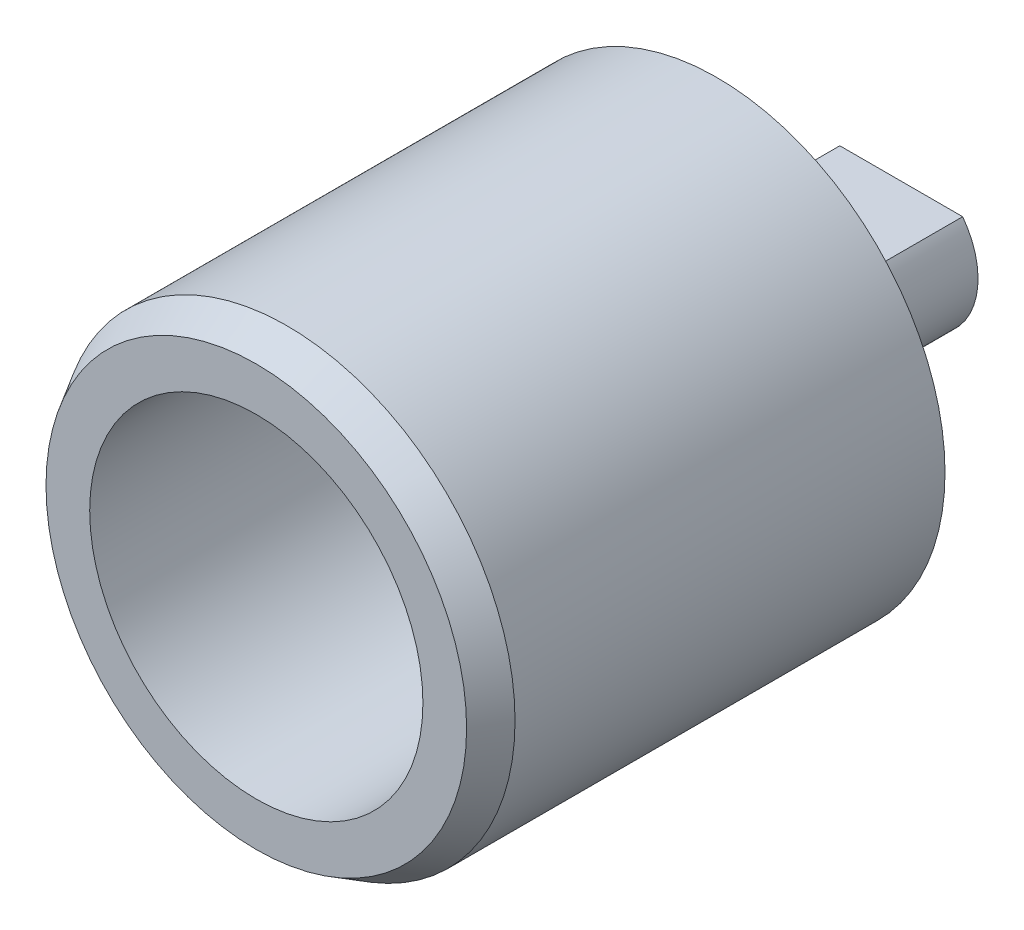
from build123d import *

# Parameters (mm, degrees)
BOSS_EXTRUDE1_DEPTH = 6
SKETCH4_R           = 7.425
BOSS_EXTRUDE2_DEPTH = 15
SKETCH7_R           = 5.425
CUT_EXTRUDE2_DEPTH  = 14.5
CHAMFER3_SIZE       = 1
CHAMFER3_SIZE2      = 0.577350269


with BuildPart() as part:
    # Sketch1 → Boss-Extrude1 (new body)
    with BuildSketch(Plane.XY):
        with BuildLine():
            Line((-2, 1.5), (2, 1.5))
            ThreePointArc((2, 1.5), (0, -2.5), (-2, 1.5))
        make_face()
    extrude(amount=-BOSS_EXTRUDE1_DEPTH)

    # Sketch4 → Boss-Extrude2 (add)
    with BuildSketch(Plane.XY):
        Circle(SKETCH4_R)
    extrude(amount=BOSS_EXTRUDE2_DEPTH)

    # Sketch7 → Cut-Extrude2 (cut)
    with BuildSketch(Plane.XY.offset(15)):
        Circle(SKETCH7_R)
    extrude(amount=-CUT_EXTRUDE2_DEPTH, mode=Mode.SUBTRACT)

    # Chamfer3
    chamfer3_edges = [part.edges().sort_by_distance(p)[0] for p in [
        (-7.425, 0, 15),
    ]]
    chamfer3_side = [part.faces().sort_by_distance(p)[0] for p in [
        (-7.425, 0, 7.5),
    ]]
    chamfer(chamfer3_edges, length=CHAMFER3_SIZE, length2=CHAMFER3_SIZE2, reference=chamfer3_side[0])


solid = part.part
